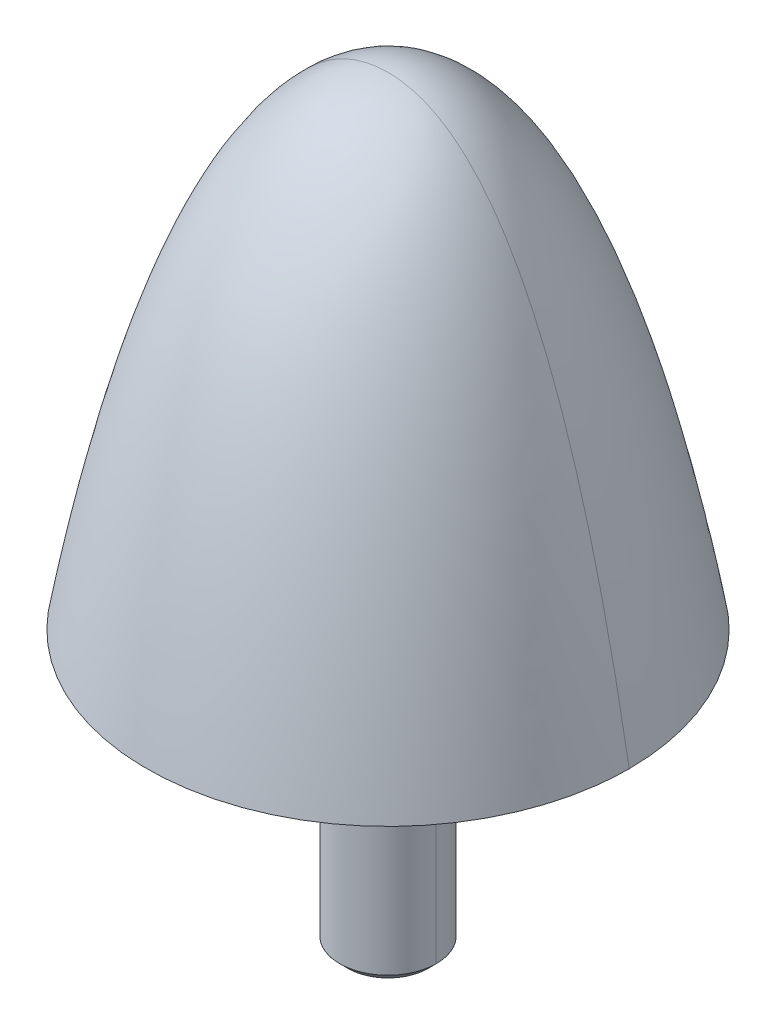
ISO-10303-21;
HEADER;
FILE_DESCRIPTION(('STEP AP214'),'2;1');
FILE_NAME('part.step','',(''),(''),'','','');
FILE_SCHEMA(('AUTOMOTIVE_DESIGN { 1 0 10303 214 1 1 1 1 }'));
ENDSEC;
DATA;
#1=APPLICATION_CONTEXT('core data for automotive mechanical design processes');
#2=APPLICATION_PROTOCOL_DEFINITION('international standard','automotive_design',2000,#1);
#3=PRODUCT_CONTEXT('',#1,'mechanical');
#4=PRODUCT('Part','Part','',(#3));
#5=PRODUCT_RELATED_PRODUCT_CATEGORY('part','',(#4));
#6=PRODUCT_DEFINITION_FORMATION('','',#4);
#7=PRODUCT_DEFINITION_CONTEXT('part definition',#1,'design');
#8=PRODUCT_DEFINITION('design','',#6,#7);
#9=PRODUCT_DEFINITION_SHAPE('','',#8);
#10=(LENGTH_UNIT() NAMED_UNIT(*) SI_UNIT(.MILLI.,.METRE.));
#11=(NAMED_UNIT(*) PLANE_ANGLE_UNIT() SI_UNIT($,.RADIAN.));
#12=(NAMED_UNIT(*) SI_UNIT($,.STERADIAN.) SOLID_ANGLE_UNIT());
#13=UNCERTAINTY_MEASURE_WITH_UNIT(LENGTH_MEASURE(1.E-05),#10,'distance_accuracy_value','');
#14=(GEOMETRIC_REPRESENTATION_CONTEXT(3) GLOBAL_UNCERTAINTY_ASSIGNED_CONTEXT((#13)) GLOBAL_UNIT_ASSIGNED_CONTEXT((#10,
#11,#12)) REPRESENTATION_CONTEXT('',''));
#15=CARTESIAN_POINT('',(0.,0.,0.));
#16=DIRECTION('',(0.,0.,1.));
#17=DIRECTION('',(1.,0.,0.));
#18=AXIS2_PLACEMENT_3D('',#15,#16,#17);
#19=CARTESIAN_POINT('',(0.,30.,0.));
#20=CARTESIAN_POINT('',(0.,30.0000000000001,0.));
#21=CARTESIAN_POINT('',(0.,30.0000000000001,0.));
#22=CARTESIAN_POINT('',(0.,30.,0.));
#23=CARTESIAN_POINT('',(0.8443354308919,30.,0.));
#24=CARTESIAN_POINT('',(0.844335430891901,30.0000000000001,1.68867086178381));
#25=CARTESIAN_POINT('',(-0.844335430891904,30.0000000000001,1.6886708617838));
#26=CARTESIAN_POINT('',(-0.8443354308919,30.,0.));
#27=CARTESIAN_POINT('',(2.2638744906,29.679261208,0.));
#28=CARTESIAN_POINT('',(2.2638744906,29.679261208,4.52774898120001));
#29=CARTESIAN_POINT('',(-2.26387449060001,29.679261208,4.52774898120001));
#30=CARTESIAN_POINT('',(-2.2638744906,29.679261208,0.));
#31=CARTESIAN_POINT('',(3.974168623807,28.69879103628,0.));
#32=CARTESIAN_POINT('',(3.974168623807,28.69879103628,7.94833724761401));
#33=CARTESIAN_POINT('',(-3.97416862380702,28.69879103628,7.94833724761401));
#34=CARTESIAN_POINT('',(-3.974168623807,28.69879103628,0.));
#35=CARTESIAN_POINT('',(5.410510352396,27.39183710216,0.));
#36=CARTESIAN_POINT('',(5.41051035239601,27.39183710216,10.821020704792));
#37=CARTESIAN_POINT('',(-5.41051035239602,27.39183710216,10.821020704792));
#38=CARTESIAN_POINT('',(-5.410510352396,27.39183710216,0.));
#39=CARTESIAN_POINT('',(7.067570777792,25.34168568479,0.));
#40=CARTESIAN_POINT('',(7.067570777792,25.34168568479,14.135141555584));
#41=CARTESIAN_POINT('',(-7.06757077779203,25.34168568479,14.135141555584));
#42=CARTESIAN_POINT('',(-7.067570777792,25.34168568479,0.));
#43=CARTESIAN_POINT('',(8.777763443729,22.34861502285,0.));
#44=CARTESIAN_POINT('',(8.777763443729,22.34861502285,17.555526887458));
#45=CARTESIAN_POINT('',(-8.77776344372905,22.34861502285,17.555526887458));
#46=CARTESIAN_POINT('',(-8.777763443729,22.34861502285,0.));
#47=CARTESIAN_POINT('',(10.46136383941,18.31761314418,0.));
#48=CARTESIAN_POINT('',(10.46136383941,18.31761314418,20.9227276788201));
#49=CARTESIAN_POINT('',(-10.46136383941,18.31761314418,20.92272767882));
#50=CARTESIAN_POINT('',(-10.46136383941,18.31761314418,0.));
#51=CARTESIAN_POINT('',(11.87936576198,13.97008333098,0.));
#52=CARTESIAN_POINT('',(11.87936576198,13.97008333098,23.7587315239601));
#53=CARTESIAN_POINT('',(-11.8793657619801,13.97008333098,23.7587315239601));
#54=CARTESIAN_POINT('',(-11.87936576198,13.97008333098,0.));
#55=CARTESIAN_POINT('',(13.4728324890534,7.9602507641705,0.));
#56=CARTESIAN_POINT('',(13.4728324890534,7.9602507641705,26.9456649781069));
#57=CARTESIAN_POINT('',(-13.4728324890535,7.9602507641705,26.9456649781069));
#58=CARTESIAN_POINT('',(-13.4728324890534,7.9602507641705,0.));
#59=CARTESIAN_POINT('',(14.4342076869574,3.20960041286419,0.));
#60=CARTESIAN_POINT('',(14.4342076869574,3.20960041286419,28.8684153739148));
#61=CARTESIAN_POINT('',(-14.4342076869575,3.20960041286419,28.8684153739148));
#62=CARTESIAN_POINT('',(-14.4342076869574,3.20960041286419,0.));
#63=CARTESIAN_POINT('',(15.0000075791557,1.33608135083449E-06,0.));
#64=CARTESIAN_POINT('',(15.0000075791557,1.33608135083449E-06,30.0000151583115));
#65=CARTESIAN_POINT('',(-15.0000075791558,1.33608135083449E-06,30.0000151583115));
#66=CARTESIAN_POINT('',(-15.0000075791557,1.33608135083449E-06,0.));
#67=(BOUNDED_SURFACE() B_SPLINE_SURFACE(3,3,((#19,#20,#21,#22),(#23,#24,#25,#26),(#27,#28,#29,
#30),(#31,#32,#33,#34),(#35,#36,#37,#38),(#39,#40,#41,#42),(#43,#44,#45,#46),(#47,#48,#49,#50),
(#51,#52,#53,#54),(#55,#56,#57,#58),(#59,#60,#61,#62),(#63,#64,#65,#66)),.UNSPECIFIED.,.F.,.F.,
.F.) B_SPLINE_SURFACE_WITH_KNOTS((4,1,1,1,1,1,1,1,1,4),(4,4),(0.,0.0625,0.125,0.1875,0.25,0.375,
0.5,0.625,0.75,0.991238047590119),(0.,1.),
.UNSPECIFIED.) GEOMETRIC_REPRESENTATION_ITEM() RATIONAL_B_SPLINE_SURFACE(((1.,0.333333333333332,
0.333333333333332,1.),(1.,0.333333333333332,0.333333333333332,1.),(1.,0.333333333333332,
0.333333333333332,1.),(1.,0.333333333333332,0.333333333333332,1.),(1.,0.333333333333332,
0.333333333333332,1.),(1.,0.333333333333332,0.333333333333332,1.),(1.,0.333333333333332,
0.333333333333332,1.),(1.,0.333333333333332,0.333333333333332,1.),(1.,0.333333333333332,
0.333333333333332,1.),(1.,0.333333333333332,0.333333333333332,1.),(1.,0.333333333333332,
0.333333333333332,1.),(1.,0.333333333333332,0.333333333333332,1.))) REPRESENTATION_ITEM('') SURFACE());
#68=CARTESIAN_POINT('',(-15.0000075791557,1.33608135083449E-06,0.));
#69=CARTESIAN_POINT('',(-15.0000075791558,1.33608135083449E-06,30.0000151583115));
#70=CARTESIAN_POINT('',(15.0000075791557,1.33608135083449E-06,30.0000151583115));
#71=CARTESIAN_POINT('',(15.0000075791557,1.33608135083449E-06,0.));
#72=(BOUNDED_CURVE() B_SPLINE_CURVE(3,(#68,#69,#70,#71),.UNSPECIFIED.,.F.,
.F.) B_SPLINE_CURVE_WITH_KNOTS((4,4),(0.,1.),
.UNSPECIFIED.) CURVE() GEOMETRIC_REPRESENTATION_ITEM() RATIONAL_B_SPLINE_CURVE((1.,
0.333333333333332,0.333333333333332,1.)) REPRESENTATION_ITEM(''));
#73=CARTESIAN_POINT('',(-15.0000037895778,6.68040675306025E-07,0.));
#74=VERTEX_POINT('',#73);
#75=CARTESIAN_POINT('',(15.0000037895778,6.68040675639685E-07,0.));
#76=VERTEX_POINT('',#75);
#77=EDGE_CURVE('P0_E64',#74,#76,#72,.T.);
#78=CARTESIAN_POINT('',(15.0000075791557,1.33608135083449E-06,0.));
#79=CARTESIAN_POINT('',(14.4342076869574,3.20960041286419,0.));
#80=CARTESIAN_POINT('',(13.4728324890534,7.9602507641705,0.));
#81=CARTESIAN_POINT('',(11.87936576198,13.97008333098,0.));
#82=CARTESIAN_POINT('',(10.46136383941,18.31761314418,0.));
#83=CARTESIAN_POINT('',(8.777763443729,22.34861502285,0.));
#84=CARTESIAN_POINT('',(7.067570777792,25.34168568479,0.));
#85=CARTESIAN_POINT('',(5.410510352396,27.39183710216,0.));
#86=CARTESIAN_POINT('',(3.974168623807,28.69879103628,0.));
#87=CARTESIAN_POINT('',(2.2638744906,29.679261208,0.));
#88=CARTESIAN_POINT('',(0.8443354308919,30.,0.));
#89=CARTESIAN_POINT('',(0.,30.,0.));
#90=(BOUNDED_CURVE() B_SPLINE_CURVE(3,(#78,#79,#80,#81,#82,#83,#84,#85,#86,#87,#88,#89),
.UNSPECIFIED.,.F.,.F.) B_SPLINE_CURVE_WITH_KNOTS((4,1,1,1,1,1,1,1,1,4),(0.,0.241238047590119,
0.366238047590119,0.491238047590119,0.616238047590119,0.741238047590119,0.803738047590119,
0.866238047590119,0.928738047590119,0.991238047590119),
.UNSPECIFIED.) CURVE() GEOMETRIC_REPRESENTATION_ITEM() RATIONAL_B_SPLINE_CURVE((1.,1.,1.,1.,1.,
1.,1.,1.,1.,1.,1.,1.)) REPRESENTATION_ITEM(''));
#91=CARTESIAN_POINT('',(0.,30.,0.));
#92=VERTEX_POINT('',#91);
#93=EDGE_CURVE('P0_E58',#76,#92,#90,.T.);
#94=CARTESIAN_POINT('',(0.,30.,0.));
#95=CARTESIAN_POINT('',(-0.8443354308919,30.,0.));
#96=CARTESIAN_POINT('',(-2.2638744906,29.679261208,0.));
#97=CARTESIAN_POINT('',(-3.974168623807,28.69879103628,0.));
#98=CARTESIAN_POINT('',(-5.410510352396,27.39183710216,0.));
#99=CARTESIAN_POINT('',(-7.067570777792,25.34168568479,0.));
#100=CARTESIAN_POINT('',(-8.777763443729,22.34861502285,0.));
#101=CARTESIAN_POINT('',(-10.46136383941,18.31761314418,0.));
#102=CARTESIAN_POINT('',(-11.87936576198,13.97008333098,0.));
#103=CARTESIAN_POINT('',(-13.4728324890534,7.9602507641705,0.));
#104=CARTESIAN_POINT('',(-14.4342076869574,3.20960041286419,0.));
#105=CARTESIAN_POINT('',(-15.0000075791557,1.33608135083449E-06,0.));
#106=(BOUNDED_CURVE() B_SPLINE_CURVE(3,(#94,#95,#96,#97,#98,#99,#100,#101,#102,#103,#104,#105),
.UNSPECIFIED.,.F.,.F.) B_SPLINE_CURVE_WITH_KNOTS((4,1,1,1,1,1,1,1,1,4),(0.,0.0625,0.125,0.1875,
0.25,0.375,0.5,0.625,0.75,0.991238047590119),
.UNSPECIFIED.) CURVE() GEOMETRIC_REPRESENTATION_ITEM() RATIONAL_B_SPLINE_CURVE((1.,1.,1.,1.,1.,
1.,1.,1.,1.,1.,1.,1.)) REPRESENTATION_ITEM(''));
#107=EDGE_CURVE('P0_E61',#92,#74,#106,.T.);
#108=ORIENTED_EDGE('',*,*,#77,.T.);
#109=ORIENTED_EDGE('',*,*,#93,.T.);
#110=ORIENTED_EDGE('',*,*,#107,.T.);
#111=EDGE_LOOP('',(#108,#109,#110));
#112=FACE_BOUND('',#111,.T.);
#113=ADVANCED_FACE('P0_F16',(#112),#67,.F.);
#114=CARTESIAN_POINT('',(0.,30.,0.));
#115=CARTESIAN_POINT('',(0.,30.,0.));
#116=CARTESIAN_POINT('',(0.,30.,0.));
#117=CARTESIAN_POINT('',(0.,30.,0.));
#118=CARTESIAN_POINT('',(-0.8443354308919,30.,0.));
#119=CARTESIAN_POINT('',(-0.8443354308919,30.,-1.6886708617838));
#120=CARTESIAN_POINT('',(0.844335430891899,30.,-1.6886708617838));
#121=CARTESIAN_POINT('',(0.8443354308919,30.,0.));
#122=CARTESIAN_POINT('',(-2.2638744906,29.679261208,0.));
#123=CARTESIAN_POINT('',(-2.2638744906,29.679261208,-4.5277489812));
#124=CARTESIAN_POINT('',(2.2638744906,29.679261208,-4.5277489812));
#125=CARTESIAN_POINT('',(2.2638744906,29.679261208,0.));
#126=CARTESIAN_POINT('',(-3.974168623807,28.69879103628,0.));
#127=CARTESIAN_POINT('',(-3.974168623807,28.69879103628,-7.94833724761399));
#128=CARTESIAN_POINT('',(3.97416862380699,28.69879103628,-7.94833724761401));
#129=CARTESIAN_POINT('',(3.974168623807,28.69879103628,0.));
#130=CARTESIAN_POINT('',(-5.410510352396,27.39183710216,0.));
#131=CARTESIAN_POINT('',(-5.41051035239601,27.39183710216,-10.821020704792));
#132=CARTESIAN_POINT('',(5.41051035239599,27.39183710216,-10.821020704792));
#133=CARTESIAN_POINT('',(5.410510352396,27.39183710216,0.));
#134=CARTESIAN_POINT('',(-7.067570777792,25.34168568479,0.));
#135=CARTESIAN_POINT('',(-7.06757077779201,25.34168568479,-14.135141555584));
#136=CARTESIAN_POINT('',(7.06757077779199,25.34168568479,-14.135141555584));
#137=CARTESIAN_POINT('',(7.067570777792,25.34168568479,0.));
#138=CARTESIAN_POINT('',(-8.777763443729,22.34861502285,0.));
#139=CARTESIAN_POINT('',(-8.777763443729,22.34861502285,-17.555526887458));
#140=CARTESIAN_POINT('',(8.77776344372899,22.34861502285,-17.555526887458));
#141=CARTESIAN_POINT('',(8.777763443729,22.34861502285,0.));
#142=CARTESIAN_POINT('',(-10.46136383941,18.31761314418,0.));
#143=CARTESIAN_POINT('',(-10.46136383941,18.31761314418,-20.92272767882));
#144=CARTESIAN_POINT('',(10.46136383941,18.31761314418,-20.92272767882));
#145=CARTESIAN_POINT('',(10.46136383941,18.31761314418,0.));
#146=CARTESIAN_POINT('',(-11.87936576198,13.97008333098,0.));
#147=CARTESIAN_POINT('',(-11.87936576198,13.97008333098,-23.75873152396));
#148=CARTESIAN_POINT('',(11.87936576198,13.97008333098,-23.75873152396));
#149=CARTESIAN_POINT('',(11.87936576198,13.97008333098,0.));
#150=CARTESIAN_POINT('',(-13.4728324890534,7.9602507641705,0.));
#151=CARTESIAN_POINT('',(-13.4728324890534,7.9602507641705,-26.9456649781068));
#152=CARTESIAN_POINT('',(13.4728324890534,7.9602507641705,-26.9456649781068));
#153=CARTESIAN_POINT('',(13.4728324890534,7.9602507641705,0.));
#154=CARTESIAN_POINT('',(-14.4342076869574,3.20960041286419,0.));
#155=CARTESIAN_POINT('',(-14.4342076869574,3.20960041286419,-28.8684153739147));
#156=CARTESIAN_POINT('',(14.4342076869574,3.20960041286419,-28.8684153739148));
#157=CARTESIAN_POINT('',(14.4342076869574,3.20960041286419,0.));
#158=CARTESIAN_POINT('',(-15.0000075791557,1.33608135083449E-06,0.));
#159=CARTESIAN_POINT('',(-15.0000075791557,1.33608135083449E-06,-30.0000151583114));
#160=CARTESIAN_POINT('',(15.0000075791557,1.33608135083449E-06,-30.0000151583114));
#161=CARTESIAN_POINT('',(15.0000075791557,1.33608135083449E-06,0.));
#162=(BOUNDED_SURFACE() B_SPLINE_SURFACE(3,3,((#114,#115,#116,#117),(#118,#119,#120,#121),(#122,
#123,#124,#125),(#126,#127,#128,#129),(#130,#131,#132,#133),(#134,#135,#136,#137),(#138,#139,
#140,#141),(#142,#143,#144,#145),(#146,#147,#148,#149),(#150,#151,#152,#153),(#154,#155,#156,
#157),(#158,#159,#160,#161)),.UNSPECIFIED.,.F.,.F.,.F.) B_SPLINE_SURFACE_WITH_KNOTS((4,1,1,1,1,
1,1,1,1,4),(4,4),(0.,0.0625,0.125,0.1875,0.25,0.375,0.5,0.625,0.75,0.991238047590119),(0.,1.),
.UNSPECIFIED.) GEOMETRIC_REPRESENTATION_ITEM() RATIONAL_B_SPLINE_SURFACE(((1.,0.333333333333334,
0.333333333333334,1.),(1.,0.333333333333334,0.333333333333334,1.),(1.,0.333333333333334,
0.333333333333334,1.),(1.,0.333333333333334,0.333333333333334,1.),(1.,0.333333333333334,
0.333333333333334,1.),(1.,0.333333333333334,0.333333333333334,1.),(1.,0.333333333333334,
0.333333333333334,1.),(1.,0.333333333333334,0.333333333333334,1.),(1.,0.333333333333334,
0.333333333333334,1.),(1.,0.333333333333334,0.333333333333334,1.),(1.,0.333333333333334,
0.333333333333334,1.),(1.,0.333333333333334,0.333333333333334,1.))) REPRESENTATION_ITEM('') SURFACE());
#163=CARTESIAN_POINT('',(15.0000075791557,1.33608135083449E-06,0.));
#164=CARTESIAN_POINT('',(15.0000075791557,1.33608135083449E-06,-30.0000151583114));
#165=CARTESIAN_POINT('',(-15.0000075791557,1.33608135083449E-06,-30.0000151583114));
#166=CARTESIAN_POINT('',(-15.0000075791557,1.33608135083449E-06,0.));
#167=(BOUNDED_CURVE() B_SPLINE_CURVE(3,(#163,#164,#165,#166),.UNSPECIFIED.,.F.,
.F.) B_SPLINE_CURVE_WITH_KNOTS((4,4),(0.,1.),
.UNSPECIFIED.) CURVE() GEOMETRIC_REPRESENTATION_ITEM() RATIONAL_B_SPLINE_CURVE((1.,
0.333333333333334,0.333333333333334,1.)) REPRESENTATION_ITEM(''));
#168=EDGE_CURVE('P0_E74',#76,#74,#167,.T.);
#169=ORIENTED_EDGE('',*,*,#107,.F.);
#170=ORIENTED_EDGE('',*,*,#93,.F.);
#171=ORIENTED_EDGE('',*,*,#168,.T.);
#172=EDGE_LOOP('',(#169,#170,#171));
#173=FACE_BOUND('',#172,.T.);
#174=ADVANCED_FACE('P0_F73',(#173),#162,.F.);
#175=CARTESIAN_POINT('',(0.,-16.75000000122,0.));
#176=DIRECTION('',(0.,1.,0.));
#177=DIRECTION('',(0.,0.,-1.));
#178=AXIS2_PLACEMENT_3D('',#175,#176,#177);
#179=CONICAL_SURFACE('',#178,2.749999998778,0.785398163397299);
#180=CARTESIAN_POINT('',(-2.99999999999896,-16.499999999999,5.47380988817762E-09));
#181=CARTESIAN_POINT('',(-2.97916666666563,-16.5208333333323,5.51182315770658E-09));
#182=CARTESIAN_POINT('',(-2.9583333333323,-16.5416666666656,5.54825169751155E-09));
#183=CARTESIAN_POINT('',(-2.91666666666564,-16.5833333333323,5.61794063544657E-09));
#184=CARTESIAN_POINT('',(-2.89583333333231,-16.6041666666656,5.65120103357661E-09));
#185=CARTESIAN_POINT('',(-2.85416666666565,-16.6458333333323,5.71455500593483E-09));
#186=CARTESIAN_POINT('',(-2.83333333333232,-16.6666666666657,5.74464858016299E-09));
#187=CARTESIAN_POINT('',(-2.79166666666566,-16.7083333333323,5.80166747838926E-09));
#188=CARTESIAN_POINT('',(-2.77083333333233,-16.7291666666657,5.82859280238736E-09));
#189=CARTESIAN_POINT('',(-2.72916666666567,-16.7708333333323,5.87927575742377E-09));
#190=CARTESIAN_POINT('',(-2.70833333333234,-16.7916666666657,5.90303338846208E-09));
#191=CARTESIAN_POINT('',(-2.66666666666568,-16.8333333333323,5.94738143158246E-09));
#192=CARTESIAN_POINT('',(-2.64583333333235,-16.8541666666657,5.96797184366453E-09));
#193=CARTESIAN_POINT('',(-2.60416666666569,-16.8958333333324,6.00598416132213E-09));
#194=CARTESIAN_POINT('',(-2.58333333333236,-16.9166666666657,6.02340606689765E-09));
#195=CARTESIAN_POINT('',(-2.5416666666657,-16.9583333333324,6.05508255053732E-09));
#196=CARTESIAN_POINT('',(-2.52083333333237,-16.9791666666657,6.06933712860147E-09));
#197=CARTESIAN_POINT('',(-2.49999999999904,-16.999999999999,6.08200863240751E-09));
#198=B_SPLINE_CURVE_WITH_KNOTS('',3,(#180,#181,#182,#183,#184,#185,#186,#187,#188,#189,#190,
#191,#192,#193,#194,#195,#196,#197),.UNSPECIFIED.,.F.,.F.,(4,2,2,2,2,2,2,2,4),(0.,
0.0883883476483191,0.176776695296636,0.265165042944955,0.353553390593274,0.441941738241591,
0.53033008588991,0.618718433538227,0.707106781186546),.UNSPECIFIED.);
#199=CARTESIAN_POINT('',(-2.99999999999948,-16.4999999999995,2.73690121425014E-09));
#200=VERTEX_POINT('',#199);
#201=CARTESIAN_POINT('',(-2.49999999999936,-16.9999999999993,2.02733407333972E-09));
#202=VERTEX_POINT('',#201);
#203=EDGE_CURVE('P0_E147',#200,#202,#198,.T.);
#204=ORIENTED_EDGE('',*,*,#203,.T.);
#205=CARTESIAN_POINT('',(2.5,-17.,0.));
#206=CARTESIAN_POINT('',(2.5,-17.,0.496994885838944));
#207=CARTESIAN_POINT('',(2.30969883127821,-17.,0.956708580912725));
#208=CARTESIAN_POINT('',(2.11970910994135,-17.,1.41566990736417));
#209=CARTESIAN_POINT('',(1.76776695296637,-17.,1.76776695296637));
#210=CARTESIAN_POINT('',(1.41660244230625,-17.,2.11908601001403));
#211=CARTESIAN_POINT('',(0.956708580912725,-17.,2.30969883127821));
#212=CARTESIAN_POINT('',(0.497830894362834,-17.,2.49989047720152));
#213=CARTESIAN_POINT('',(0.,-17.,2.5));
#214=CARTESIAN_POINT('',(-0.496730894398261,-17.,2.50010928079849));
#215=CARTESIAN_POINT('',(-0.956708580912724,-17.,2.30969883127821));
#216=CARTESIAN_POINT('',(-1.41566990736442,-17.,2.11970910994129));
#217=CARTESIAN_POINT('',(-1.76776695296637,-17.,1.76776695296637));
#218=CARTESIAN_POINT('',(-2.11908601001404,-17.,1.41660244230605));
#219=CARTESIAN_POINT('',(-2.30969883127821,-17.,0.956708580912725));
#220=CARTESIAN_POINT('',(-2.5,-17.,0.497566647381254));
#221=CARTESIAN_POINT('',(-2.5,-17.,0.));
#222=B_SPLINE_CURVE_WITH_KNOTS('',2,(#205,#206,#207,#208,#209,#210,#211,#212,#213,#214,#215,
#216,#217,#218,#219,#220,#221),.UNSPECIFIED.,.F.,.F.,(3,2,2,2,2,2,2,2,3),(0.,0.125,0.25,0.375,
0.5,0.625,0.75,0.875,1.),.UNSPECIFIED.);
#223=CARTESIAN_POINT('',(2.49999999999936,-16.9999999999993,-2.02733360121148E-09));
#224=VERTEX_POINT('',#223);
#225=EDGE_CURVE('P0_E137',#224,#202,#222,.T.);
#226=ORIENTED_EDGE('',*,*,#225,.F.);
#227=CARTESIAN_POINT('',(2.49999999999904,-16.999999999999,-6.08200110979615E-09));
#228=CARTESIAN_POINT('',(2.52083333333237,-16.9791666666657,-6.06933124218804E-09));
#229=CARTESIAN_POINT('',(2.5416666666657,-16.9583333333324,-6.05507688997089E-09));
#230=CARTESIAN_POINT('',(2.58333333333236,-16.9166666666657,-6.0233997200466E-09));
#231=CARTESIAN_POINT('',(2.60416666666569,-16.8958333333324,-6.00597690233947E-09));
#232=CARTESIAN_POINT('',(2.64583333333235,-16.8541666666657,-5.96796330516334E-09));
#233=CARTESIAN_POINT('',(2.66666666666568,-16.8333333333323,-5.94737252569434E-09));
#234=CARTESIAN_POINT('',(2.70833333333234,-16.7916666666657,-5.90302492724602E-09));
#235=CARTESIAN_POINT('',(2.72916666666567,-16.7708333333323,-5.87926810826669E-09));
#236=CARTESIAN_POINT('',(2.77083333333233,-16.7291666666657,-5.82858512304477E-09));
#237=CARTESIAN_POINT('',(2.79166666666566,-16.7083333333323,-5.80165895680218E-09));
#238=CARTESIAN_POINT('',(2.83333333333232,-16.6666666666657,-5.74463892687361E-09));
#239=CARTESIAN_POINT('',(2.85416666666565,-16.6458333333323,-5.71454506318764E-09));
#240=CARTESIAN_POINT('',(2.89583333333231,-16.6041666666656,-5.65119112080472E-09));
#241=CARTESIAN_POINT('',(2.91666666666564,-16.5833333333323,-5.61793104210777E-09));
#242=CARTESIAN_POINT('',(2.9583333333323,-16.5416666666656,-5.5482423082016E-09));
#243=CARTESIAN_POINT('',(2.97916666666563,-16.5208333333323,-5.51181365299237E-09));
#244=CARTESIAN_POINT('',(2.99999999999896,-16.499999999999,-5.47379952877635E-09));
#245=B_SPLINE_CURVE_WITH_KNOTS('',3,(#227,#228,#229,#230,#231,#232,#233,#234,#235,#236,#237,
#238,#239,#240,#241,#242,#243,#244),.UNSPECIFIED.,.F.,.F.,(4,2,2,2,2,2,2,2,4),(0.,
0.0883883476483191,0.176776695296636,0.265165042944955,0.353553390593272,0.441941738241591,
0.53033008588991,0.618718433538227,0.707106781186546),.UNSPECIFIED.);
#246=CARTESIAN_POINT('',(2.99999999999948,-16.4999999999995,-1.36845068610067E-09));
#247=VERTEX_POINT('',#246);
#248=EDGE_CURVE('P0_E38',#224,#247,#245,.T.);
#249=ORIENTED_EDGE('',*,*,#248,.T.);
#250=CARTESIAN_POINT('',(0.,-16.5,0.));
#251=DIRECTION('',(0.,1.,0.));
#252=DIRECTION('',(-1.,0.,0.));
#253=AXIS2_PLACEMENT_3D('',#250,#251,#252);
#254=CIRCLE('',#253,3.);
#255=EDGE_CURVE('P0_E158',#200,#247,#254,.T.);
#256=ORIENTED_EDGE('',*,*,#255,.F.);
#257=EDGE_LOOP('',(#204,#226,#249,#256));
#258=FACE_BOUND('',#257,.T.);
#259=ADVANCED_FACE('P0_F93',(#258),#179,.T.);
#260=CARTESIAN_POINT('',(0.,-17.,0.));
#261=DIRECTION('',(0.,-1.,0.));
#262=DIRECTION('',(0.,0.,-1.));
#263=AXIS2_PLACEMENT_3D('',#260,#261,#262);
#264=PLANE('',#263);
#265=ORIENTED_EDGE('',*,*,#225,.T.);
#266=CARTESIAN_POINT('',(0.,-16.999999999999,0.));
#267=DIRECTION('',(0.,1.,0.));
#268=DIRECTION('',(1.,0.,0.));
#269=AXIS2_PLACEMENT_3D('',#266,#267,#268);
#270=CIRCLE('',#269,2.49999999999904);
#271=EDGE_CURVE('P0_E152',#224,#202,#270,.T.);
#272=ORIENTED_EDGE('',*,*,#271,.F.);
#273=EDGE_LOOP('',(#265,#272));
#274=FACE_BOUND('',#273,.T.);
#275=ADVANCED_FACE('P0_F111',(#274),#264,.T.);
#276=CARTESIAN_POINT('',(0.,0.,0.));
#277=DIRECTION('',(0.,1.,0.));
#278=DIRECTION('',(1.,0.,0.));
#279=AXIS2_PLACEMENT_3D('',#276,#277,#278);
#280=PLANE('',#279);
#281=ORIENTED_EDGE('',*,*,#77,.F.);
#282=ORIENTED_EDGE('',*,*,#168,.F.);
#283=EDGE_LOOP('',(#281,#282));
#284=FACE_BOUND('',#283,.T.);
#285=CARTESIAN_POINT('',(0.,0.,0.));
#286=DIRECTION('',(0.,-1.,0.));
#287=DIRECTION('',(1.,0.,0.));
#288=AXIS2_PLACEMENT_3D('',#285,#286,#287);
#289=CIRCLE('',#288,3.);
#290=CARTESIAN_POINT('',(3.,0.,0.));
#291=VERTEX_POINT('',#290);
#292=CARTESIAN_POINT('',(-3.,0.,0.));
#293=VERTEX_POINT('',#292);
#294=EDGE_CURVE('P0_E218',#291,#293,#289,.T.);
#295=ORIENTED_EDGE('',*,*,#294,.F.);
#296=CARTESIAN_POINT('',(0.,0.,0.));
#297=DIRECTION('',(0.,-1.,0.));
#298=DIRECTION('',(-1.,0.,0.));
#299=AXIS2_PLACEMENT_3D('',#296,#297,#298);
#300=CIRCLE('',#299,3.);
#301=EDGE_CURVE('P0_E255',#293,#291,#300,.T.);
#302=ORIENTED_EDGE('',*,*,#301,.F.);
#303=EDGE_LOOP('',(#295,#302));
#304=FACE_BOUND('',#303,.T.);
#305=ADVANCED_FACE('P0_F180',(#284,#304),#280,.F.);
#306=CARTESIAN_POINT('',(0.,0.,0.));
#307=DIRECTION('',(0.,-1.,0.));
#308=DIRECTION('',(1.,0.,0.));
#309=AXIS2_PLACEMENT_3D('',#306,#307,#308);
#310=CYLINDRICAL_SURFACE('',#309,3.);
#311=CARTESIAN_POINT('',(-3.,-16.5,5.4737937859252E-09));
#312=CARTESIAN_POINT('',(-3.,-15.8125,5.24571709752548E-09));
#313=CARTESIAN_POINT('',(-3.,-15.125,5.01764221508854E-09));
#314=CARTESIAN_POINT('',(-3.,-13.75,4.56149333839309E-09));
#315=CARTESIAN_POINT('',(-3.,-13.0625,4.33341934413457E-09));
#316=CARTESIAN_POINT('',(-3.,-11.6875,3.8772695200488E-09));
#317=CARTESIAN_POINT('',(-3.,-11.,3.64919369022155E-09));
#318=CARTESIAN_POINT('',(-3.,-9.625,3.19304315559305E-09));
#319=CARTESIAN_POINT('',(-3.,-8.9375,2.9649684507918E-09));
#320=CARTESIAN_POINT('',(-3.,-7.5625,2.50881904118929E-09));
#321=CARTESIAN_POINT('',(-3.,-6.875,2.28074433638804E-09));
#322=CARTESIAN_POINT('',(-3.,-5.5,1.82459380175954E-09));
#323=CARTESIAN_POINT('',(-3.,-4.8125,1.59651797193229E-09));
#324=CARTESIAN_POINT('',(-3.,-3.4375,1.14036814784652E-09));
#325=CARTESIAN_POINT('',(-3.,-2.75,9.12294153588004E-10));
#326=CARTESIAN_POINT('',(-3.,-1.375,4.56145276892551E-10));
#327=CARTESIAN_POINT('',(-3.,-0.687499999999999,2.28070394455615E-10));
#328=CARTESIAN_POINT('',(-3.,0.,0.));
#329=B_SPLINE_CURVE_WITH_KNOTS('',3,(#311,#312,#313,#314,#315,#316,#317,#318,#319,#320,#321,
#322,#323,#324,#325,#326,#327,#328),.UNSPECIFIED.,.F.,.F.,(4,2,2,2,2,2,2,2,4),(0.,2.0625,4.125,
6.1875,8.25,10.3125,12.375,14.4375,16.5),.UNSPECIFIED.);
#330=EDGE_CURVE('P0_E157',#200,#293,#329,.T.);
#331=ORIENTED_EDGE('',*,*,#330,.F.);
#332=ORIENTED_EDGE('',*,*,#255,.T.);
#333=CARTESIAN_POINT('',(3.,0.,0.));
#334=CARTESIAN_POINT('',(3.,-0.687499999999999,-2.30595049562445E-10));
#335=CARTESIAN_POINT('',(3.,-1.375,-4.00384513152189E-10));
#336=CARTESIAN_POINT('',(3.,-2.75,-6.25926660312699E-10));
#337=CARTESIAN_POINT('',(3.,-3.4375,-6.81679343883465E-10));
#338=CARTESIAN_POINT('',(3.,-4.8125,-6.86747498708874E-10));
#339=CARTESIAN_POINT('',(3.,-5.5,-6.36062969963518E-10));
#340=CARTESIAN_POINT('',(3.,-6.875,-3.90248203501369E-10));
#341=CARTESIAN_POINT('',(3.,-7.5625,-1.95117965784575E-10));
#342=CARTESIAN_POINT('',(3.,-8.93750000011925,1.95143141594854E-10));
#343=CARTESIAN_POINT('',(3.,-9.6250000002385,3.90274011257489E-10));
#344=CARTESIAN_POINT('',(3.,-11.0000000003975,6.36087513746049E-10));
#345=CARTESIAN_POINT('',(3.,-11.6875000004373,6.86770146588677E-10));
#346=CARTESIAN_POINT('',(3.,-13.0625000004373,6.81701718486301E-10));
#347=CARTESIAN_POINT('',(3.,-13.7500000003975,6.25950657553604E-10));
#348=CARTESIAN_POINT('',(3.,-15.1250000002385,4.00410867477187E-10));
#349=CARTESIAN_POINT('',(3.,-15.8125000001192,2.30622138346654E-10));
#350=CARTESIAN_POINT('',(3.,-16.5,0.));
#351=B_SPLINE_CURVE_WITH_KNOTS('',3,(#333,#334,#335,#336,#337,#338,#339,#340,#341,#342,#343,
#344,#345,#346,#347,#348,#349,#350),.UNSPECIFIED.,.F.,.F.,(4,2,2,2,2,2,2,2,4),(0.,2.0625,4.125,
6.1875,8.25,10.3125000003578,12.375000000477,14.4375000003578,16.5),.UNSPECIFIED.);
#352=EDGE_CURVE('P0_E30',#291,#247,#351,.T.);
#353=ORIENTED_EDGE('',*,*,#352,.F.);
#354=ORIENTED_EDGE('',*,*,#294,.T.);
#355=EDGE_LOOP('',(#331,#332,#353,#354));
#356=FACE_BOUND('',#355,.T.);
#357=ADVANCED_FACE('P0_F189',(#356),#310,.T.);
#358=CARTESIAN_POINT('',(0.,-16.75000000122,0.));
#359=DIRECTION('',(0.,1.,0.));
#360=DIRECTION('',(0.,0.,-1.));
#361=AXIS2_PLACEMENT_3D('',#358,#359,#360);
#362=CONICAL_SURFACE('',#361,2.749999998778,0.785398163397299);
#363=ORIENTED_EDGE('',*,*,#248,.F.);
#364=ORIENTED_EDGE('',*,*,#271,.T.);
#365=ORIENTED_EDGE('',*,*,#203,.F.);
#366=CARTESIAN_POINT('',(0.,-16.5,0.));
#367=DIRECTION('',(0.,1.,0.));
#368=DIRECTION('',(1.,0.,0.));
#369=AXIS2_PLACEMENT_3D('',#366,#367,#368);
#370=CIRCLE('',#369,3.);
#371=EDGE_CURVE('P0_E11',#247,#200,#370,.T.);
#372=ORIENTED_EDGE('',*,*,#371,.F.);
#373=EDGE_LOOP('',(#363,#364,#365,#372));
#374=FACE_BOUND('',#373,.T.);
#375=ADVANCED_FACE('P0_F246',(#374),#362,.T.);
#376=CARTESIAN_POINT('',(0.,0.,0.));
#377=DIRECTION('',(0.,-1.,0.));
#378=DIRECTION('',(1.,0.,0.));
#379=AXIS2_PLACEMENT_3D('',#376,#377,#378);
#380=CYLINDRICAL_SURFACE('',#379,3.);
#381=ORIENTED_EDGE('',*,*,#352,.T.);
#382=ORIENTED_EDGE('',*,*,#371,.T.);
#383=ORIENTED_EDGE('',*,*,#330,.T.);
#384=ORIENTED_EDGE('',*,*,#301,.T.);
#385=EDGE_LOOP('',(#381,#382,#383,#384));
#386=FACE_BOUND('',#385,.T.);
#387=ADVANCED_FACE('P0_F254',(#386),#380,.T.);
#388=CLOSED_SHELL('',(#113,#174,#259,#275,#305,#357,#375,#387));
#389=MANIFOLD_SOLID_BREP('P0_B1',#388);
#390=CARTESIAN_POINT('',(0.,0.,0.));
#391=DIRECTION('',(0.,-1.,0.));
#392=DIRECTION('',(1.,0.,0.));
#393=AXIS2_PLACEMENT_3D('',#390,#391,#392);
#394=CYLINDRICAL_SURFACE('',#393,2.7);
#395=CARTESIAN_POINT('',(2.7,0.,0.));
#396=DIRECTION('',(0.,-1.,0.));
#397=VECTOR('',#396,1.);
#398=LINE('',#395,#397);
#399=CARTESIAN_POINT('',(2.7,0.,0.));
#400=VERTEX_POINT('',#399);
#401=CARTESIAN_POINT('',(2.7,-16.5,0.));
#402=VERTEX_POINT('',#401);
#403=EDGE_CURVE('P1_E27',#400,#402,#398,.T.);
#404=ORIENTED_EDGE('',*,*,#403,.T.);
#405=CARTESIAN_POINT('',(0.,-16.5,0.));
#406=DIRECTION('',(0.,1.,0.));
#407=DIRECTION('',(1.,0.,0.));
#408=AXIS2_PLACEMENT_3D('',#405,#406,#407);
#409=CIRCLE('',#408,2.7);
#410=CARTESIAN_POINT('',(-2.7,-16.5,0.));
#411=VERTEX_POINT('',#410);
#412=EDGE_CURVE('P1_E11',#402,#411,#409,.T.);
#413=ORIENTED_EDGE('',*,*,#412,.T.);
#414=CARTESIAN_POINT('',(-2.7,-16.5,0.));
#415=DIRECTION('',(0.,1.,0.));
#416=VECTOR('',#415,1.);
#417=LINE('',#414,#416);
#418=CARTESIAN_POINT('',(-2.7,0.,0.));
#419=VERTEX_POINT('',#418);
#420=EDGE_CURVE('P1_E52',#411,#419,#417,.T.);
#421=ORIENTED_EDGE('',*,*,#420,.T.);
#422=CARTESIAN_POINT('',(0.,0.,0.));
#423=DIRECTION('',(0.,-1.,0.));
#424=DIRECTION('',(-1.,0.,0.));
#425=AXIS2_PLACEMENT_3D('',#422,#423,#424);
#426=CIRCLE('',#425,2.7);
#427=EDGE_CURVE('P1_E125',#419,#400,#426,.T.);
#428=ORIENTED_EDGE('',*,*,#427,.T.);
#429=EDGE_LOOP('',(#404,#413,#421,#428));
#430=FACE_BOUND('',#429,.T.);
#431=ADVANCED_FACE('P1_F16',(#430),#394,.T.);
#432=CARTESIAN_POINT('',(0.,-16.5,0.));
#433=DIRECTION('',(0.,-1.,0.));
#434=DIRECTION('',(0.,0.,-1.));
#435=AXIS2_PLACEMENT_3D('',#432,#433,#434);
#436=PLANE('',#435);
#437=CARTESIAN_POINT('',(3.,-16.5,0.));
#438=CARTESIAN_POINT('',(3.,-16.5,-0.597297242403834));
#439=CARTESIAN_POINT('',(2.77163859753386,-16.5,-1.14805029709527));
#440=CARTESIAN_POINT('',(2.54266585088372,-16.5,-1.7002777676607));
#441=CARTESIAN_POINT('',(2.12132034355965,-16.5,-2.12132034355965));
#442=CARTESIAN_POINT('',(1.69844868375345,-16.5,-2.54388797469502));
#443=CARTESIAN_POINT('',(1.14805029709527,-16.5,-2.77163859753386));
#444=CARTESIAN_POINT('',(0.595658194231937,-16.5,-3.0002142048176));
#445=CARTESIAN_POINT('',(0.,-16.5,-3.));
#446=CARTESIAN_POINT('',(-0.597815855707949,-16.5,-2.99978501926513));
#447=CARTESIAN_POINT('',(-1.14805029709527,-16.5,-2.77163859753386));
#448=CARTESIAN_POINT('',(-1.70027786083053,-16.5,-2.5426657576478));
#449=CARTESIAN_POINT('',(-2.12132034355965,-16.5,-2.12132034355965));
#450=CARTESIAN_POINT('',(-2.54388797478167,-16.5,-1.69844868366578));
#451=CARTESIAN_POINT('',(-2.77163859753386,-16.5,-1.14805029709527));
#452=CARTESIAN_POINT('',(-3.,-16.5,-0.596175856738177));
#453=CARTESIAN_POINT('',(-3.,-16.5,0.));
#454=B_SPLINE_CURVE_WITH_KNOTS('',2,(#437,#438,#439,#440,#441,#442,#443,#444,#445,#446,#447,
#448,#449,#450,#451,#452,#453),.UNSPECIFIED.,.F.,.F.,(3,2,2,2,2,2,2,2,3),(0.,0.125,0.25,0.375,
0.5,0.625,0.75,0.875,1.),.UNSPECIFIED.);
#455=CARTESIAN_POINT('',(-3.,-16.5,0.));
#456=VERTEX_POINT('',#455);
#457=CARTESIAN_POINT('',(3.,-16.5,0.));
#458=VERTEX_POINT('',#457);
#459=EDGE_CURVE('P1_E53',#456,#458,#454,.F.);
#460=ORIENTED_EDGE('',*,*,#459,.F.);
#461=CARTESIAN_POINT('',(-3.,-16.5,0.));
#462=CARTESIAN_POINT('',(-3.,-16.5,0.597297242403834));
#463=CARTESIAN_POINT('',(-2.77163859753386,-16.5,1.14805029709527));
#464=CARTESIAN_POINT('',(-2.54266585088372,-16.5,1.7002777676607));
#465=CARTESIAN_POINT('',(-2.12132034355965,-16.5,2.12132034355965));
#466=CARTESIAN_POINT('',(-1.69844868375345,-16.5,2.54388797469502));
#467=CARTESIAN_POINT('',(-1.14805029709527,-16.5,2.77163859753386));
#468=CARTESIAN_POINT('',(-0.595658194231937,-16.5,3.0002142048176));
#469=CARTESIAN_POINT('',(0.,-16.5,3.));
#470=CARTESIAN_POINT('',(0.597815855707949,-16.5,2.99978501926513));
#471=CARTESIAN_POINT('',(1.14805029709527,-16.5,2.77163859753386));
#472=CARTESIAN_POINT('',(1.70027786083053,-16.5,2.5426657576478));
#473=CARTESIAN_POINT('',(2.12132034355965,-16.5,2.12132034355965));
#474=CARTESIAN_POINT('',(2.54388797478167,-16.5,1.69844868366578));
#475=CARTESIAN_POINT('',(2.77163859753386,-16.5,1.14805029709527));
#476=CARTESIAN_POINT('',(3.,-16.5,0.596175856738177));
#477=CARTESIAN_POINT('',(3.,-16.5,0.));
#478=B_SPLINE_CURVE_WITH_KNOTS('',2,(#461,#462,#463,#464,#465,#466,#467,#468,#469,#470,#471,
#472,#473,#474,#475,#476,#477),.UNSPECIFIED.,.F.,.F.,(3,2,2,2,2,2,2,2,3),(0.,0.125,0.25,0.375,
0.5,0.625,0.75,0.875,1.),.UNSPECIFIED.);
#479=EDGE_CURVE('P1_E48',#458,#456,#478,.F.);
#480=ORIENTED_EDGE('',*,*,#479,.F.);
#481=EDGE_LOOP('',(#460,#480));
#482=FACE_BOUND('',#481,.T.);
#483=ORIENTED_EDGE('',*,*,#412,.F.);
#484=CARTESIAN_POINT('',(0.,-16.5,0.));
#485=DIRECTION('',(0.,1.,0.));
#486=DIRECTION('',(-1.,0.,0.));
#487=AXIS2_PLACEMENT_3D('',#484,#485,#486);
#488=CIRCLE('',#487,2.7);
#489=EDGE_CURVE('P1_E35',#411,#402,#488,.T.);
#490=ORIENTED_EDGE('',*,*,#489,.F.);
#491=EDGE_LOOP('',(#483,#490));
#492=FACE_BOUND('',#491,.T.);
#493=ADVANCED_FACE('P1_F55',(#482,#492),#436,.F.);
#494=CARTESIAN_POINT('',(0.,0.,0.));
#495=DIRECTION('',(0.,-1.,0.));
#496=DIRECTION('',(1.,0.,0.));
#497=AXIS2_PLACEMENT_3D('',#494,#495,#496);
#498=CYLINDRICAL_SURFACE('',#497,2.7);
#499=ORIENTED_EDGE('',*,*,#420,.F.);
#500=ORIENTED_EDGE('',*,*,#489,.T.);
#501=ORIENTED_EDGE('',*,*,#403,.F.);
#502=CARTESIAN_POINT('',(0.,0.,0.));
#503=DIRECTION('',(0.,-1.,0.));
#504=DIRECTION('',(1.,0.,0.));
#505=AXIS2_PLACEMENT_3D('',#502,#503,#504);
#506=CIRCLE('',#505,2.7);
#507=EDGE_CURVE('P1_E102',#400,#419,#506,.T.);
#508=ORIENTED_EDGE('',*,*,#507,.T.);
#509=EDGE_LOOP('',(#499,#500,#501,#508));
#510=FACE_BOUND('',#509,.T.);
#511=ADVANCED_FACE('P1_F17',(#510),#498,.T.);
#512=OPEN_SHELL('',(#431,#493,#511));
#513=SHELL_BASED_SURFACE_MODEL('P1_B1',(#512));
#514=ADVANCED_BREP_SHAPE_REPRESENTATION('',(#18,#389),#14);
#515=MANIFOLD_SURFACE_SHAPE_REPRESENTATION('',(#18,#513),#14);
#516=SHAPE_REPRESENTATION('',(#18),#14);
#517=SHAPE_DEFINITION_REPRESENTATION(#9,#516);
#518=SHAPE_REPRESENTATION_RELATIONSHIP('','',#516,#514);
#519=SHAPE_REPRESENTATION_RELATIONSHIP('','',#516,#515);
ENDSEC;
END-ISO-10303-21;
